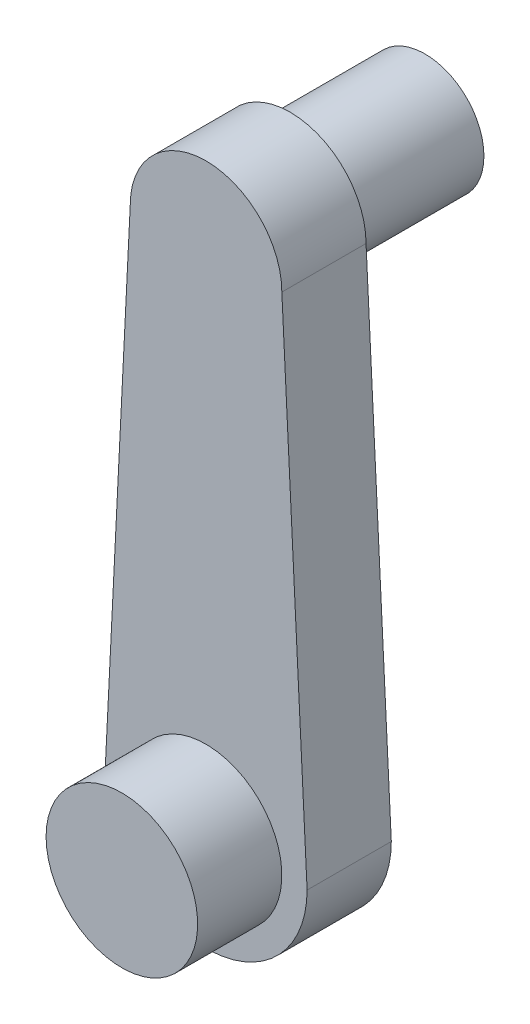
ISO-10303-21;
HEADER;
FILE_DESCRIPTION(('STEP AP214'),'2;1');
FILE_NAME('part.step','',(''),(''),'','','');
FILE_SCHEMA(('AUTOMOTIVE_DESIGN { 1 0 10303 214 1 1 1 1 }'));
ENDSEC;
DATA;
#1=APPLICATION_CONTEXT('core data for automotive mechanical design processes');
#2=APPLICATION_PROTOCOL_DEFINITION('international standard','automotive_design',2000,#1);
#3=PRODUCT_CONTEXT('',#1,'mechanical');
#4=PRODUCT('Part','Part','',(#3));
#5=PRODUCT_RELATED_PRODUCT_CATEGORY('part','',(#4));
#6=PRODUCT_DEFINITION_FORMATION('','',#4);
#7=PRODUCT_DEFINITION_CONTEXT('part definition',#1,'design');
#8=PRODUCT_DEFINITION('design','',#6,#7);
#9=PRODUCT_DEFINITION_SHAPE('','',#8);
#10=(LENGTH_UNIT() NAMED_UNIT(*) SI_UNIT(.MILLI.,.METRE.));
#11=(NAMED_UNIT(*) PLANE_ANGLE_UNIT() SI_UNIT($,.RADIAN.));
#12=(NAMED_UNIT(*) SI_UNIT($,.STERADIAN.) SOLID_ANGLE_UNIT());
#13=UNCERTAINTY_MEASURE_WITH_UNIT(LENGTH_MEASURE(1.E-05),#10,'distance_accuracy_value','');
#14=(GEOMETRIC_REPRESENTATION_CONTEXT(3) GLOBAL_UNCERTAINTY_ASSIGNED_CONTEXT((#13)) GLOBAL_UNIT_ASSIGNED_CONTEXT((#10,
#11,#12)) REPRESENTATION_CONTEXT('',''));
#15=CARTESIAN_POINT('',(0.,0.,0.));
#16=DIRECTION('',(0.,0.,1.));
#17=DIRECTION('',(1.,0.,0.));
#18=AXIS2_PLACEMENT_3D('',#15,#16,#17);
#19=CARTESIAN_POINT('',(0.,0.,12.6999999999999));
#20=DIRECTION('',(0.,0.,-0.999999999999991));
#21=DIRECTION('',(-1.00000000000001,0.,0.));
#22=AXIS2_PLACEMENT_3D('',#19,#20,#21);
#23=PLANE('',#22);
#24=CARTESIAN_POINT('',(0.,0.,12.6999999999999));
#25=DIRECTION('',(0.,0.,0.999999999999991));
#26=DIRECTION('',(-1.00000000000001,0.,0.));
#27=AXIS2_PLACEMENT_3D('',#24,#25,#26);
#28=CIRCLE('',#27,15.24);
#29=CARTESIAN_POINT('',(-15.2400000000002,0.,12.6999999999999));
#30=VERTEX_POINT('',#29);
#31=CARTESIAN_POINT('',(15.2400000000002,0.,12.6999999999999));
#32=VERTEX_POINT('',#31);
#33=EDGE_CURVE('E110',#30,#32,#28,.T.);
#34=ORIENTED_EDGE('',*,*,#33,.T.);
#35=DIRECTION('',(-0.0499376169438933,0.998752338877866,0.));
#36=VECTOR('',#35,1.);
#37=CARTESIAN_POINT('',(11.4300000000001,76.2000000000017,12.6999999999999));
#38=LINE('',#37,#36);
#39=CARTESIAN_POINT('',(11.4300000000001,76.2000000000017,12.6999999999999));
#40=VERTEX_POINT('',#39);
#41=EDGE_CURVE('E94',#32,#40,#38,.T.);
#42=ORIENTED_EDGE('',*,*,#41,.T.);
#43=CARTESIAN_POINT('',(0.,76.2000000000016,12.6999999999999));
#44=DIRECTION('',(0.,0.,0.999999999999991));
#45=DIRECTION('',(1.00000000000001,0.,0.));
#46=AXIS2_PLACEMENT_3D('',#43,#44,#45);
#47=CIRCLE('',#46,11.43);
#48=CARTESIAN_POINT('',(-11.4300000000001,76.200000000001,12.6999999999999));
#49=VERTEX_POINT('',#48);
#50=EDGE_CURVE('E60',#40,#49,#47,.T.);
#51=ORIENTED_EDGE('',*,*,#50,.T.);
#52=DIRECTION('',(-0.0499376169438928,-0.998752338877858,0.));
#53=VECTOR('',#52,1.);
#54=CARTESIAN_POINT('',(-11.4300000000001,76.200000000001,12.6999999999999));
#55=LINE('',#54,#53);
#56=EDGE_CURVE('E55',#49,#30,#55,.T.);
#57=ORIENTED_EDGE('',*,*,#56,.T.);
#58=EDGE_LOOP('',(#34,#42,#51,#57));
#59=FACE_BOUND('',#58,.T.);
#60=CARTESIAN_POINT('',(0.,0.,12.6999999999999));
#61=DIRECTION('',(0.,0.,0.999999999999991));
#62=DIRECTION('',(1.00000000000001,0.,0.));
#63=AXIS2_PLACEMENT_3D('',#60,#61,#62);
#64=CIRCLE('',#63,11.43);
#65=CARTESIAN_POINT('',(-11.4300000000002,0.,12.6999999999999));
#66=VERTEX_POINT('',#65);
#67=EDGE_CURVE('E11',#66,#66,#64,.T.);
#68=ORIENTED_EDGE('',*,*,#67,.F.);
#69=EDGE_LOOP('',(#68));
#70=FACE_BOUND('',#69,.T.);
#71=ADVANCED_FACE('F38',(#59,#70),#23,.F.);
#72=CARTESIAN_POINT('',(0.,0.,12.6999999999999));
#73=DIRECTION('',(0.,0.,-0.999999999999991));
#74=DIRECTION('',(-1.00000000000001,0.,0.));
#75=AXIS2_PLACEMENT_3D('',#72,#73,#74);
#76=CYLINDRICAL_SURFACE('',#75,15.24);
#77=CARTESIAN_POINT('',(0.,0.,0.));
#78=DIRECTION('',(0.,0.,0.999999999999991));
#79=DIRECTION('',(-1.00000000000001,0.,0.));
#80=AXIS2_PLACEMENT_3D('',#77,#78,#79);
#81=CIRCLE('',#80,15.24);
#82=CARTESIAN_POINT('',(-15.2400000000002,0.,0.));
#83=VERTEX_POINT('',#82);
#84=CARTESIAN_POINT('',(15.2400000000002,0.,0.));
#85=VERTEX_POINT('',#84);
#86=EDGE_CURVE('E86',#83,#85,#81,.T.);
#87=ORIENTED_EDGE('',*,*,#86,.T.);
#88=DIRECTION('',(0.,0.,-0.999999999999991));
#89=VECTOR('',#88,1.);
#90=CARTESIAN_POINT('',(15.2400000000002,0.,12.6999999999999));
#91=LINE('',#90,#89);
#92=EDGE_CURVE('E42',#32,#85,#91,.T.);
#93=ORIENTED_EDGE('',*,*,#92,.F.);
#94=ORIENTED_EDGE('',*,*,#33,.F.);
#95=DIRECTION('',(0.,0.,-0.999999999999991));
#96=VECTOR('',#95,1.);
#97=CARTESIAN_POINT('',(-15.2400000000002,0.,12.6999999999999));
#98=LINE('',#97,#96);
#99=EDGE_CURVE('E99',#30,#83,#98,.T.);
#100=ORIENTED_EDGE('',*,*,#99,.T.);
#101=EDGE_LOOP('',(#87,#93,#94,#100));
#102=FACE_BOUND('',#101,.T.);
#103=ADVANCED_FACE('F40',(#102),#76,.T.);
#104=CARTESIAN_POINT('',(11.4300000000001,76.2000000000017,12.6999999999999));
#105=DIRECTION('',(-0.998752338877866,-0.0499376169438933,0.));
#106=DIRECTION('',(0.0499376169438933,-0.998752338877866,0.));
#107=AXIS2_PLACEMENT_3D('',#104,#105,#106);
#108=PLANE('',#107);
#109=DIRECTION('',(-0.0499376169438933,0.998752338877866,0.));
#110=VECTOR('',#109,1.);
#111=CARTESIAN_POINT('',(11.4300000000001,76.2000000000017,0.));
#112=LINE('',#111,#110);
#113=CARTESIAN_POINT('',(11.4300000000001,76.2000000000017,0.));
#114=VERTEX_POINT('',#113);
#115=EDGE_CURVE('E81',#85,#114,#112,.T.);
#116=ORIENTED_EDGE('',*,*,#115,.T.);
#117=DIRECTION('',(0.,0.,-0.999999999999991));
#118=VECTOR('',#117,1.);
#119=CARTESIAN_POINT('',(11.4300000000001,76.2000000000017,12.6999999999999));
#120=LINE('',#119,#118);
#121=EDGE_CURVE('E97',#40,#114,#120,.T.);
#122=ORIENTED_EDGE('',*,*,#121,.F.);
#123=ORIENTED_EDGE('',*,*,#41,.F.);
#124=ORIENTED_EDGE('',*,*,#92,.T.);
#125=EDGE_LOOP('',(#116,#122,#123,#124));
#126=FACE_BOUND('',#125,.T.);
#127=ADVANCED_FACE('F93',(#126),#108,.F.);
#128=CARTESIAN_POINT('',(0.,76.2000000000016,12.6999999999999));
#129=DIRECTION('',(0.,0.,-0.999999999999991));
#130=DIRECTION('',(-1.00000000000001,0.,0.));
#131=AXIS2_PLACEMENT_3D('',#128,#129,#130);
#132=CYLINDRICAL_SURFACE('',#131,11.43);
#133=CARTESIAN_POINT('',(0.,76.2000000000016,0.));
#134=DIRECTION('',(0.,0.,0.999999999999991));
#135=DIRECTION('',(1.00000000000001,0.,0.));
#136=AXIS2_PLACEMENT_3D('',#133,#134,#135);
#137=CIRCLE('',#136,11.43);
#138=CARTESIAN_POINT('',(-11.4300000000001,76.200000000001,0.));
#139=VERTEX_POINT('',#138);
#140=EDGE_CURVE('E87',#114,#139,#137,.T.);
#141=ORIENTED_EDGE('',*,*,#140,.T.);
#142=DIRECTION('',(0.,0.,-0.999999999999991));
#143=VECTOR('',#142,1.);
#144=CARTESIAN_POINT('',(-11.4300000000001,76.200000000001,12.6999999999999));
#145=LINE('',#144,#143);
#146=EDGE_CURVE('E116',#49,#139,#145,.T.);
#147=ORIENTED_EDGE('',*,*,#146,.F.);
#148=ORIENTED_EDGE('',*,*,#50,.F.);
#149=ORIENTED_EDGE('',*,*,#121,.T.);
#150=EDGE_LOOP('',(#141,#147,#148,#149));
#151=FACE_BOUND('',#150,.T.);
#152=ADVANCED_FACE('F119',(#151),#132,.T.);
#153=CARTESIAN_POINT('',(-11.4300000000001,76.200000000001,12.6999999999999));
#154=DIRECTION('',(0.998752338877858,-0.0499376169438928,0.));
#155=DIRECTION('',(0.0499376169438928,0.998752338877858,0.));
#156=AXIS2_PLACEMENT_3D('',#153,#154,#155);
#157=PLANE('',#156);
#158=DIRECTION('',(-0.0499376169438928,-0.998752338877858,0.));
#159=VECTOR('',#158,1.);
#160=CARTESIAN_POINT('',(-11.4300000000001,76.200000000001,0.));
#161=LINE('',#160,#159);
#162=EDGE_CURVE('E108',#139,#83,#161,.T.);
#163=ORIENTED_EDGE('',*,*,#162,.T.);
#164=ORIENTED_EDGE('',*,*,#99,.F.);
#165=ORIENTED_EDGE('',*,*,#56,.F.);
#166=ORIENTED_EDGE('',*,*,#146,.T.);
#167=EDGE_LOOP('',(#163,#164,#165,#166));
#168=FACE_BOUND('',#167,.T.);
#169=ADVANCED_FACE('F121',(#168),#157,.F.);
#170=CARTESIAN_POINT('',(0.,0.,0.));
#171=DIRECTION('',(0.,0.,-0.999999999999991));
#172=DIRECTION('',(-1.00000000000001,0.,0.));
#173=AXIS2_PLACEMENT_3D('',#170,#171,#172);
#174=PLANE('',#173);
#175=CARTESIAN_POINT('',(0.,76.2000000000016,0.));
#176=DIRECTION('',(0.,0.,-0.999999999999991));
#177=DIRECTION('',(-1.00000000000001,0.,0.));
#178=AXIS2_PLACEMENT_3D('',#175,#176,#177);
#179=CIRCLE('',#178,8.89);
#180=CARTESIAN_POINT('',(8.89000000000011,76.2000000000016,0.));
#181=VERTEX_POINT('',#180);
#182=EDGE_CURVE('E47',#181,#181,#179,.T.);
#183=ORIENTED_EDGE('',*,*,#182,.F.);
#184=EDGE_LOOP('',(#183));
#185=FACE_BOUND('',#184,.T.);
#186=ORIENTED_EDGE('',*,*,#86,.F.);
#187=ORIENTED_EDGE('',*,*,#162,.F.);
#188=ORIENTED_EDGE('',*,*,#140,.F.);
#189=ORIENTED_EDGE('',*,*,#115,.F.);
#190=EDGE_LOOP('',(#186,#187,#188,#189));
#191=FACE_BOUND('',#190,.T.);
#192=ADVANCED_FACE('F83',(#185,#191),#174,.T.);
#193=CARTESIAN_POINT('',(0.,76.2000000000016,-20.3199999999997));
#194=DIRECTION('',(0.,0.,0.999999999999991));
#195=DIRECTION('',(1.00000000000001,0.,0.));
#196=AXIS2_PLACEMENT_3D('',#193,#194,#195);
#197=CYLINDRICAL_SURFACE('',#196,8.89);
#198=CARTESIAN_POINT('',(0.,76.2000000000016,-20.3199999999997));
#199=DIRECTION('',(0.,0.,-0.999999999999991));
#200=DIRECTION('',(-1.00000000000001,0.,0.));
#201=AXIS2_PLACEMENT_3D('',#198,#199,#200);
#202=CIRCLE('',#201,8.89);
#203=CARTESIAN_POINT('',(8.89000000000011,76.2000000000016,-20.3199999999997));
#204=VERTEX_POINT('',#203);
#205=EDGE_CURVE('E100',#204,#204,#202,.T.);
#206=CARTESIAN_POINT('',(8.89000000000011,76.2000000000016,-20.3199999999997));
#207=CARTESIAN_POINT('',(8.89000000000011,76.2000000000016,-20.108333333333));
#208=CARTESIAN_POINT('',(8.89000000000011,76.2000000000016,-19.8966666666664));
#209=CARTESIAN_POINT('',(8.89000000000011,76.2000000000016,-19.473333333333));
#210=CARTESIAN_POINT('',(8.89000000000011,76.2000000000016,-19.2616666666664));
#211=CARTESIAN_POINT('',(8.89000000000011,76.2000000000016,-18.838333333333));
#212=CARTESIAN_POINT('',(8.89000000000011,76.2000000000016,-18.6266666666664));
#213=CARTESIAN_POINT('',(8.89000000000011,76.2000000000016,-18.2033333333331));
#214=CARTESIAN_POINT('',(8.89000000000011,76.2000000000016,-17.9916666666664));
#215=CARTESIAN_POINT('',(8.89000000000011,76.2000000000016,-17.5683333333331));
#216=CARTESIAN_POINT('',(8.89000000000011,76.2000000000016,-17.3566666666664));
#217=CARTESIAN_POINT('',(8.89000000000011,76.2000000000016,-16.9333333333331));
#218=CARTESIAN_POINT('',(8.89000000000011,76.2000000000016,-16.7216666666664));
#219=CARTESIAN_POINT('',(8.89000000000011,76.2000000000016,-16.2983333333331));
#220=CARTESIAN_POINT('',(8.89000000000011,76.2000000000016,-16.0866666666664));
#221=CARTESIAN_POINT('',(8.89000000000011,76.2000000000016,-15.6633333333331));
#222=CARTESIAN_POINT('',(8.89000000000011,76.2000000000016,-15.4516666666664));
#223=CARTESIAN_POINT('',(8.89000000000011,76.2000000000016,-15.0283333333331));
#224=CARTESIAN_POINT('',(8.89000000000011,76.2000000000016,-14.8166666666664));
#225=CARTESIAN_POINT('',(8.89000000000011,76.2000000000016,-14.3933333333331));
#226=CARTESIAN_POINT('',(8.89000000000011,76.2000000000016,-14.1816666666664));
#227=CARTESIAN_POINT('',(8.89000000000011,76.2000000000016,-13.7583333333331));
#228=CARTESIAN_POINT('',(8.89000000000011,76.2000000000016,-13.5466666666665));
#229=CARTESIAN_POINT('',(8.89000000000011,76.2000000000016,-13.1233333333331));
#230=CARTESIAN_POINT('',(8.89000000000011,76.2000000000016,-12.9116666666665));
#231=CARTESIAN_POINT('',(8.89000000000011,76.2000000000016,-12.4883333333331));
#232=CARTESIAN_POINT('',(8.89000000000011,76.2000000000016,-12.2766666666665));
#233=CARTESIAN_POINT('',(8.89000000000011,76.2000000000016,-11.8533333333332));
#234=CARTESIAN_POINT('',(8.89000000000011,76.2000000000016,-11.6416666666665));
#235=CARTESIAN_POINT('',(8.89000000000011,76.2000000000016,-11.2183333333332));
#236=CARTESIAN_POINT('',(8.89000000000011,76.2000000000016,-11.0066666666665));
#237=CARTESIAN_POINT('',(8.89000000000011,76.2000000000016,-10.5833333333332));
#238=CARTESIAN_POINT('',(8.89000000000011,76.2000000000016,-10.3716666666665));
#239=CARTESIAN_POINT('',(8.89000000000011,76.2000000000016,-9.94833333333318));
#240=CARTESIAN_POINT('',(8.89000000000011,76.2000000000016,-9.73666666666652));
#241=CARTESIAN_POINT('',(8.89000000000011,76.2000000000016,-9.31333333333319));
#242=CARTESIAN_POINT('',(8.89000000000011,76.2000000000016,-9.10166666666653));
#243=CARTESIAN_POINT('',(8.89000000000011,76.2000000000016,-8.6783333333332));
#244=CARTESIAN_POINT('',(8.89000000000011,76.2000000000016,-8.46666666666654));
#245=CARTESIAN_POINT('',(8.89000000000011,76.2000000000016,-8.04333333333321));
#246=CARTESIAN_POINT('',(8.89000000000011,76.2000000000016,-7.83166666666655));
#247=CARTESIAN_POINT('',(8.89000000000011,76.2000000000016,-7.40833333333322));
#248=CARTESIAN_POINT('',(8.89000000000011,76.2000000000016,-7.19666666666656));
#249=CARTESIAN_POINT('',(8.89000000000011,76.2000000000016,-6.77333333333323));
#250=CARTESIAN_POINT('',(8.89000000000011,76.2000000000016,-6.56166666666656));
#251=CARTESIAN_POINT('',(8.89000000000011,76.2000000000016,-6.13833333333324));
#252=CARTESIAN_POINT('',(8.89000000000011,76.2000000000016,-5.92666666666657));
#253=CARTESIAN_POINT('',(8.89000000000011,76.2000000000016,-5.50333333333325));
#254=CARTESIAN_POINT('',(8.89000000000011,76.2000000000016,-5.29166666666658));
#255=CARTESIAN_POINT('',(8.89000000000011,76.2000000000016,-4.86833333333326));
#256=CARTESIAN_POINT('',(8.89000000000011,76.2000000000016,-4.65666666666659));
#257=CARTESIAN_POINT('',(8.89000000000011,76.2000000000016,-4.23333333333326));
#258=CARTESIAN_POINT('',(8.89000000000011,76.2000000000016,-4.0216666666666));
#259=CARTESIAN_POINT('',(8.89000000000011,76.2000000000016,-3.59833333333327));
#260=CARTESIAN_POINT('',(8.89000000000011,76.2000000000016,-3.38666666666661));
#261=CARTESIAN_POINT('',(8.89000000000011,76.2000000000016,-2.96333333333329));
#262=CARTESIAN_POINT('',(8.89000000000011,76.2000000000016,-2.75166666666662));
#263=CARTESIAN_POINT('',(8.89000000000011,76.2000000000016,-2.32833333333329));
#264=CARTESIAN_POINT('',(8.89000000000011,76.2000000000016,-2.11666666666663));
#265=CARTESIAN_POINT('',(8.89000000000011,76.2000000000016,-1.6933333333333));
#266=CARTESIAN_POINT('',(8.89000000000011,76.2000000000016,-1.48166666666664));
#267=CARTESIAN_POINT('',(8.89000000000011,76.2000000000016,-1.05833333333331));
#268=CARTESIAN_POINT('',(8.89000000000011,76.2000000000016,-0.84666666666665));
#269=CARTESIAN_POINT('',(8.89000000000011,76.2000000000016,-0.423333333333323));
#270=CARTESIAN_POINT('',(8.89000000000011,76.2000000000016,-0.21166666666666));
#271=CARTESIAN_POINT('',(8.89000000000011,76.2000000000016,0.));
#272=B_SPLINE_CURVE_WITH_KNOTS('',3,(#206,#207,#208,#209,#210,#211,#212,#213,#214,#215,#216,
#217,#218,#219,#220,#221,#222,#223,#224,#225,#226,#227,#228,#229,#230,#231,#232,#233,#234,#235,
#236,#237,#238,#239,#240,#241,#242,#243,#244,#245,#246,#247,#248,#249,#250,#251,#252,#253,#254,
#255,#256,#257,#258,#259,#260,#261,#262,#263,#264,#265,#266,#267,#268,#269,#270,#271),
.UNSPECIFIED.,.F.,.F.,(4,2,2,2,2,2,2,2,2,2,2,2,2,2,2,2,2,2,2,2,2,2,2,2,2,2,2,2,2,2,2,2,4),(0.,
0.63499999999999,1.26999999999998,1.90499999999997,2.53999999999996,3.17499999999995,
3.80999999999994,4.44499999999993,5.07999999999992,5.71499999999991,6.3499999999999,
6.98499999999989,7.61999999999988,8.25499999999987,8.88999999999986,9.52499999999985,
10.1599999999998,10.7949999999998,11.4299999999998,12.0649999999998,12.6999999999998,
13.3349999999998,13.9699999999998,14.6049999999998,15.2399999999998,15.8749999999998,
16.5099999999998,17.1449999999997,17.7799999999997,18.4149999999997,19.0499999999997,
19.6849999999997,20.3199999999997),.UNSPECIFIED.);
#273=EDGE_CURVE('BSEAM139',#204,#181,#272,.T.);
#274=ORIENTED_EDGE('',*,*,#205,.F.);
#275=ORIENTED_EDGE('',*,*,#182,.T.);
#276=ORIENTED_EDGE('',*,*,#273,.T.);
#277=ORIENTED_EDGE('',*,*,#273,.F.);
#278=EDGE_LOOP('',(#274,#276,#275,#277));
#279=FACE_BOUND('',#278,.T.);
#280=ADVANCED_FACE('F139',(#279),#197,.T.);
#281=CARTESIAN_POINT('',(0.,76.2000000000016,-20.3199999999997));
#282=DIRECTION('',(0.,0.,-0.999999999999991));
#283=DIRECTION('',(-1.00000000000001,0.,0.));
#284=AXIS2_PLACEMENT_3D('',#281,#282,#283);
#285=PLANE('',#284);
#286=ORIENTED_EDGE('',*,*,#205,.T.);
#287=EDGE_LOOP('',(#286));
#288=FACE_BOUND('',#287,.T.);
#289=ADVANCED_FACE('F130',(#288),#285,.T.);
#290=CARTESIAN_POINT('',(0.,0.,25.3999999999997));
#291=DIRECTION('',(0.,0.,-0.999999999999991));
#292=DIRECTION('',(-1.00000000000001,0.,0.));
#293=AXIS2_PLACEMENT_3D('',#290,#291,#292);
#294=CYLINDRICAL_SURFACE('',#293,11.43);
#295=CARTESIAN_POINT('',(0.,0.,25.3999999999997));
#296=DIRECTION('',(0.,0.,0.999999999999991));
#297=DIRECTION('',(1.00000000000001,0.,0.));
#298=AXIS2_PLACEMENT_3D('',#295,#296,#297);
#299=CIRCLE('',#298,11.43);
#300=CARTESIAN_POINT('',(-11.4300000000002,0.,25.3999999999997));
#301=VERTEX_POINT('',#300);
#302=EDGE_CURVE('E103',#301,#301,#299,.T.);
#303=CARTESIAN_POINT('',(-11.4300000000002,0.,25.3999999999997));
#304=CARTESIAN_POINT('',(-11.4300000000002,0.,25.267708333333));
#305=CARTESIAN_POINT('',(-11.4300000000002,0.,25.1354166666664));
#306=CARTESIAN_POINT('',(-11.4300000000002,0.,24.870833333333));
#307=CARTESIAN_POINT('',(-11.4300000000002,0.,24.7385416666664));
#308=CARTESIAN_POINT('',(-11.4300000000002,0.,24.4739583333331));
#309=CARTESIAN_POINT('',(-11.4300000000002,0.,24.3416666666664));
#310=CARTESIAN_POINT('',(-11.4300000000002,0.,24.0770833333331));
#311=CARTESIAN_POINT('',(-11.4300000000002,0.,23.9447916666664));
#312=CARTESIAN_POINT('',(-11.4300000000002,0.,23.6802083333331));
#313=CARTESIAN_POINT('',(-11.4300000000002,0.,23.5479166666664));
#314=CARTESIAN_POINT('',(-11.4300000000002,0.,23.2833333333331));
#315=CARTESIAN_POINT('',(-11.4300000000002,0.,23.1510416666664));
#316=CARTESIAN_POINT('',(-11.4300000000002,0.,22.8864583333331));
#317=CARTESIAN_POINT('',(-11.4300000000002,0.,22.7541666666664));
#318=CARTESIAN_POINT('',(-11.4300000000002,0.,22.4895833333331));
#319=CARTESIAN_POINT('',(-11.4300000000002,0.,22.3572916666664));
#320=CARTESIAN_POINT('',(-11.4300000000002,0.,22.0927083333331));
#321=CARTESIAN_POINT('',(-11.4300000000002,0.,21.9604166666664));
#322=CARTESIAN_POINT('',(-11.4300000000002,0.,21.6958333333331));
#323=CARTESIAN_POINT('',(-11.4300000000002,0.,21.5635416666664));
#324=CARTESIAN_POINT('',(-11.4300000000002,0.,21.2989583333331));
#325=CARTESIAN_POINT('',(-11.4300000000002,0.,21.1666666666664));
#326=CARTESIAN_POINT('',(-11.4300000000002,0.,20.9020833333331));
#327=CARTESIAN_POINT('',(-11.4300000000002,0.,20.7697916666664));
#328=CARTESIAN_POINT('',(-11.4300000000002,0.,20.5052083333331));
#329=CARTESIAN_POINT('',(-11.4300000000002,0.,20.3729166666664));
#330=CARTESIAN_POINT('',(-11.4300000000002,0.,20.1083333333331));
#331=CARTESIAN_POINT('',(-11.4300000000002,0.,19.9760416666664));
#332=CARTESIAN_POINT('',(-11.4300000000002,0.,19.7114583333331));
#333=CARTESIAN_POINT('',(-11.4300000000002,0.,19.5791666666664));
#334=CARTESIAN_POINT('',(-11.4300000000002,0.,19.3145833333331));
#335=CARTESIAN_POINT('',(-11.4300000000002,0.,19.1822916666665));
#336=CARTESIAN_POINT('',(-11.4300000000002,0.,18.9177083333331));
#337=CARTESIAN_POINT('',(-11.4300000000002,0.,18.7854166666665));
#338=CARTESIAN_POINT('',(-11.4300000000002,0.,18.5208333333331));
#339=CARTESIAN_POINT('',(-11.4300000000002,0.,18.3885416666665));
#340=CARTESIAN_POINT('',(-11.4300000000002,0.,18.1239583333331));
#341=CARTESIAN_POINT('',(-11.4300000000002,0.,17.9916666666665));
#342=CARTESIAN_POINT('',(-11.4300000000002,0.,17.7270833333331));
#343=CARTESIAN_POINT('',(-11.4300000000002,0.,17.5947916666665));
#344=CARTESIAN_POINT('',(-11.4300000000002,0.,17.3302083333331));
#345=CARTESIAN_POINT('',(-11.4300000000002,0.,17.1979166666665));
#346=CARTESIAN_POINT('',(-11.4300000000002,0.,16.9333333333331));
#347=CARTESIAN_POINT('',(-11.4300000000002,0.,16.8010416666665));
#348=CARTESIAN_POINT('',(-11.4300000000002,0.,16.5364583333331));
#349=CARTESIAN_POINT('',(-11.4300000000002,0.,16.4041666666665));
#350=CARTESIAN_POINT('',(-11.4300000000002,0.,16.1395833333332));
#351=CARTESIAN_POINT('',(-11.4300000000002,0.,16.0072916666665));
#352=CARTESIAN_POINT('',(-11.4300000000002,0.,15.7427083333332));
#353=CARTESIAN_POINT('',(-11.4300000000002,0.,15.6104166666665));
#354=CARTESIAN_POINT('',(-11.4300000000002,0.,15.3458333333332));
#355=CARTESIAN_POINT('',(-11.4300000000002,0.,15.2135416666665));
#356=CARTESIAN_POINT('',(-11.4300000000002,0.,14.9489583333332));
#357=CARTESIAN_POINT('',(-11.4300000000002,0.,14.8166666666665));
#358=CARTESIAN_POINT('',(-11.4300000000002,0.,14.5520833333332));
#359=CARTESIAN_POINT('',(-11.4300000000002,0.,14.4197916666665));
#360=CARTESIAN_POINT('',(-11.4300000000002,0.,14.1552083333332));
#361=CARTESIAN_POINT('',(-11.4300000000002,0.,14.0229166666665));
#362=CARTESIAN_POINT('',(-11.4300000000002,0.,13.7583333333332));
#363=CARTESIAN_POINT('',(-11.4300000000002,0.,13.6260416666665));
#364=CARTESIAN_POINT('',(-11.4300000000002,0.,13.3614583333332));
#365=CARTESIAN_POINT('',(-11.4300000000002,0.,13.2291666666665));
#366=CARTESIAN_POINT('',(-11.4300000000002,0.,12.9645833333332));
#367=CARTESIAN_POINT('',(-11.4300000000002,0.,12.8322916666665));
#368=CARTESIAN_POINT('',(-11.4300000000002,0.,12.6999999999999));
#369=B_SPLINE_CURVE_WITH_KNOTS('',3,(#303,#304,#305,#306,#307,#308,#309,#310,#311,#312,#313,
#314,#315,#316,#317,#318,#319,#320,#321,#322,#323,#324,#325,#326,#327,#328,#329,#330,#331,#332,
#333,#334,#335,#336,#337,#338,#339,#340,#341,#342,#343,#344,#345,#346,#347,#348,#349,#350,#351,
#352,#353,#354,#355,#356,#357,#358,#359,#360,#361,#362,#363,#364,#365,#366,#367,#368),
.UNSPECIFIED.,.F.,.F.,(4,2,2,2,2,2,2,2,2,2,2,2,2,2,2,2,2,2,2,2,2,2,2,2,2,2,2,2,2,2,2,2,4),(0.,
0.396874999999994,0.793749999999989,1.19062499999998,1.58749999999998,1.98437499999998,
2.38124999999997,2.77812499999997,3.17499999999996,3.57187499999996,3.96874999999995,
4.36562499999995,4.76249999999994,5.15937499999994,5.55624999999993,5.95312499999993,
6.34999999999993,6.74687499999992,7.14374999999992,7.54062499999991,7.93749999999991,
8.3343749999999,8.7312499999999,9.12812499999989,9.52499999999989,9.92187499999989,
10.3187499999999,10.7156249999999,11.1124999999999,11.5093749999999,11.9062499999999,
12.3031249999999,12.6999999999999),.UNSPECIFIED.);
#370=EDGE_CURVE('BSEAM127',#301,#66,#369,.T.);
#371=ORIENTED_EDGE('',*,*,#302,.F.);
#372=ORIENTED_EDGE('',*,*,#67,.T.);
#373=ORIENTED_EDGE('',*,*,#370,.T.);
#374=ORIENTED_EDGE('',*,*,#370,.F.);
#375=EDGE_LOOP('',(#371,#373,#372,#374));
#376=FACE_BOUND('',#375,.T.);
#377=ADVANCED_FACE('F127',(#376),#294,.T.);
#378=CARTESIAN_POINT('',(0.,0.,25.3999999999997));
#379=DIRECTION('',(0.,0.,0.999999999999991));
#380=DIRECTION('',(1.00000000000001,0.,0.));
#381=AXIS2_PLACEMENT_3D('',#378,#379,#380);
#382=PLANE('',#381);
#383=ORIENTED_EDGE('',*,*,#302,.T.);
#384=EDGE_LOOP('',(#383));
#385=FACE_BOUND('',#384,.T.);
#386=ADVANCED_FACE('F129',(#385),#382,.T.);
#387=CLOSED_SHELL('',(#71,#103,#127,#152,#169,#192,#280,#289,#377,#386));
#388=MANIFOLD_SOLID_BREP('B2',#387);
#389=ADVANCED_BREP_SHAPE_REPRESENTATION('',(#18,#388),#14);
#390=SHAPE_DEFINITION_REPRESENTATION(#9,#389);
ENDSEC;
END-ISO-10303-21;
